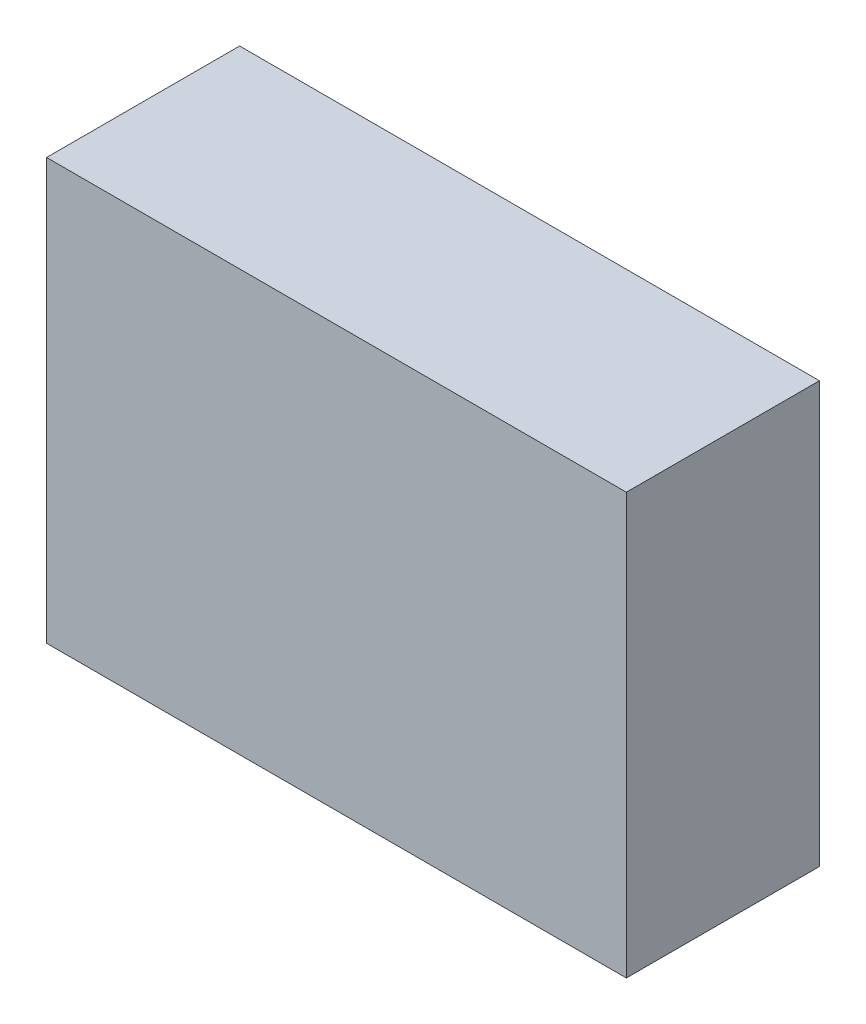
ISO-10303-21;
HEADER;
FILE_DESCRIPTION(('STEP AP214'),'2;1');
FILE_NAME('part.step','',(''),(''),'','','');
FILE_SCHEMA(('AUTOMOTIVE_DESIGN { 1 0 10303 214 1 1 1 1 }'));
ENDSEC;
DATA;
#1=APPLICATION_CONTEXT('core data for automotive mechanical design processes');
#2=APPLICATION_PROTOCOL_DEFINITION('international standard','automotive_design',2000,#1);
#3=PRODUCT_CONTEXT('',#1,'mechanical');
#4=PRODUCT('Part','Part','',(#3));
#5=PRODUCT_RELATED_PRODUCT_CATEGORY('part','',(#4));
#6=PRODUCT_DEFINITION_FORMATION('','',#4);
#7=PRODUCT_DEFINITION_CONTEXT('part definition',#1,'design');
#8=PRODUCT_DEFINITION('design','',#6,#7);
#9=PRODUCT_DEFINITION_SHAPE('','',#8);
#10=(LENGTH_UNIT() NAMED_UNIT(*) SI_UNIT(.MILLI.,.METRE.));
#11=(NAMED_UNIT(*) PLANE_ANGLE_UNIT() SI_UNIT($,.RADIAN.));
#12=(NAMED_UNIT(*) SI_UNIT($,.STERADIAN.) SOLID_ANGLE_UNIT());
#13=UNCERTAINTY_MEASURE_WITH_UNIT(LENGTH_MEASURE(1.E-05),#10,'distance_accuracy_value','');
#14=(GEOMETRIC_REPRESENTATION_CONTEXT(3) GLOBAL_UNCERTAINTY_ASSIGNED_CONTEXT((#13)) GLOBAL_UNIT_ASSIGNED_CONTEXT((#10,
#11,#12)) REPRESENTATION_CONTEXT('',''));
#15=CARTESIAN_POINT('',(0.,0.,0.));
#16=DIRECTION('',(0.,0.,1.));
#17=DIRECTION('',(1.,0.,0.));
#18=AXIS2_PLACEMENT_3D('',#15,#16,#17);
#19=CARTESIAN_POINT('',(0.,0.,16.51));
#20=DIRECTION('',(1.,0.,0.));
#21=DIRECTION('',(0.,0.,-1.));
#22=AXIS2_PLACEMENT_3D('',#19,#20,#21);
#23=PLANE('',#22);
#24=DIRECTION('',(0.,-1.,0.));
#25=VECTOR('',#24,1.);
#26=CARTESIAN_POINT('',(0.,0.,0.));
#27=LINE('',#26,#25);
#28=CARTESIAN_POINT('',(0.,35.9779903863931,0.));
#29=VERTEX_POINT('',#28);
#30=CARTESIAN_POINT('',(0.,0.,0.));
#31=VERTEX_POINT('',#30);
#32=EDGE_CURVE('E77',#29,#31,#27,.T.);
#33=ORIENTED_EDGE('',*,*,#32,.T.);
#34=DIRECTION('',(0.,0.,-1.));
#35=VECTOR('',#34,1.);
#36=CARTESIAN_POINT('',(0.,0.,16.51));
#37=LINE('',#36,#35);
#38=CARTESIAN_POINT('',(0.,0.,16.51));
#39=VERTEX_POINT('',#38);
#40=EDGE_CURVE('E11',#39,#31,#37,.T.);
#41=ORIENTED_EDGE('',*,*,#40,.F.);
#42=DIRECTION('',(0.,-1.,0.));
#43=VECTOR('',#42,1.);
#44=CARTESIAN_POINT('',(0.,0.,16.51));
#45=LINE('',#44,#43);
#46=CARTESIAN_POINT('',(0.,35.9779903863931,16.51));
#47=VERTEX_POINT('',#46);
#48=EDGE_CURVE('E95',#47,#39,#45,.T.);
#49=ORIENTED_EDGE('',*,*,#48,.F.);
#50=DIRECTION('',(0.,0.,-1.));
#51=VECTOR('',#50,1.);
#52=CARTESIAN_POINT('',(0.,35.9779903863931,16.51));
#53=LINE('',#52,#51);
#54=EDGE_CURVE('E89',#47,#29,#53,.T.);
#55=ORIENTED_EDGE('',*,*,#54,.T.);
#56=EDGE_LOOP('',(#33,#41,#49,#55));
#57=FACE_BOUND('',#56,.T.);
#58=ADVANCED_FACE('F33',(#57),#23,.F.);
#59=CARTESIAN_POINT('',(0.,0.,16.51));
#60=DIRECTION('',(0.,1.,0.));
#61=DIRECTION('',(0.,0.,1.));
#62=AXIS2_PLACEMENT_3D('',#59,#60,#61);
#63=PLANE('',#62);
#64=DIRECTION('',(1.,0.,0.));
#65=VECTOR('',#64,1.);
#66=CARTESIAN_POINT('',(0.,0.,0.));
#67=LINE('',#66,#65);
#68=CARTESIAN_POINT('',(49.5809761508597,0.,0.));
#69=VERTEX_POINT('',#68);
#70=EDGE_CURVE('E73',#31,#69,#67,.T.);
#71=ORIENTED_EDGE('',*,*,#70,.T.);
#72=DIRECTION('',(0.,0.,-1.));
#73=VECTOR('',#72,1.);
#74=CARTESIAN_POINT('',(49.5809761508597,0.,16.51));
#75=LINE('',#74,#73);
#76=CARTESIAN_POINT('',(49.5809761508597,0.,16.51));
#77=VERTEX_POINT('',#76);
#78=EDGE_CURVE('E40',#77,#69,#75,.T.);
#79=ORIENTED_EDGE('',*,*,#78,.F.);
#80=DIRECTION('',(1.,0.,0.));
#81=VECTOR('',#80,1.);
#82=CARTESIAN_POINT('',(0.,0.,16.51));
#83=LINE('',#82,#81);
#84=EDGE_CURVE('E85',#39,#77,#83,.T.);
#85=ORIENTED_EDGE('',*,*,#84,.F.);
#86=ORIENTED_EDGE('',*,*,#40,.T.);
#87=EDGE_LOOP('',(#71,#79,#85,#86));
#88=FACE_BOUND('',#87,.T.);
#89=ADVANCED_FACE('F84',(#88),#63,.F.);
#90=CARTESIAN_POINT('',(49.5809761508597,0.,16.51));
#91=DIRECTION('',(-1.,0.,0.));
#92=DIRECTION('',(0.,0.,1.));
#93=AXIS2_PLACEMENT_3D('',#90,#91,#92);
#94=PLANE('',#93);
#95=DIRECTION('',(0.,1.,0.));
#96=VECTOR('',#95,1.);
#97=CARTESIAN_POINT('',(49.5809761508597,0.,0.));
#98=LINE('',#97,#96);
#99=CARTESIAN_POINT('',(49.5809761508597,35.9779903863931,0.));
#100=VERTEX_POINT('',#99);
#101=EDGE_CURVE('E78',#69,#100,#98,.T.);
#102=ORIENTED_EDGE('',*,*,#101,.T.);
#103=DIRECTION('',(0.,0.,-1.));
#104=VECTOR('',#103,1.);
#105=CARTESIAN_POINT('',(49.5809761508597,35.9779903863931,16.51));
#106=LINE('',#105,#104);
#107=CARTESIAN_POINT('',(49.5809761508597,35.9779903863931,16.51));
#108=VERTEX_POINT('',#107);
#109=EDGE_CURVE('E101',#108,#100,#106,.T.);
#110=ORIENTED_EDGE('',*,*,#109,.F.);
#111=DIRECTION('',(0.,1.,0.));
#112=VECTOR('',#111,1.);
#113=CARTESIAN_POINT('',(49.5809761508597,0.,16.51));
#114=LINE('',#113,#112);
#115=EDGE_CURVE('E52',#77,#108,#114,.T.);
#116=ORIENTED_EDGE('',*,*,#115,.F.);
#117=ORIENTED_EDGE('',*,*,#78,.T.);
#118=EDGE_LOOP('',(#102,#110,#116,#117));
#119=FACE_BOUND('',#118,.T.);
#120=ADVANCED_FACE('F104',(#119),#94,.F.);
#121=CARTESIAN_POINT('',(0.,35.9779903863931,16.51));
#122=DIRECTION('',(0.,-1.,0.));
#123=DIRECTION('',(0.,0.,-1.));
#124=AXIS2_PLACEMENT_3D('',#121,#122,#123);
#125=PLANE('',#124);
#126=DIRECTION('',(-1.,0.,0.));
#127=VECTOR('',#126,1.);
#128=CARTESIAN_POINT('',(0.,35.9779903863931,0.));
#129=LINE('',#128,#127);
#130=EDGE_CURVE('E93',#100,#29,#129,.T.);
#131=ORIENTED_EDGE('',*,*,#130,.T.);
#132=ORIENTED_EDGE('',*,*,#54,.F.);
#133=DIRECTION('',(-1.,0.,0.));
#134=VECTOR('',#133,1.);
#135=CARTESIAN_POINT('',(0.,35.9779903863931,16.51));
#136=LINE('',#135,#134);
#137=EDGE_CURVE('E47',#108,#47,#136,.T.);
#138=ORIENTED_EDGE('',*,*,#137,.F.);
#139=ORIENTED_EDGE('',*,*,#109,.T.);
#140=EDGE_LOOP('',(#131,#132,#138,#139));
#141=FACE_BOUND('',#140,.T.);
#142=ADVANCED_FACE('F106',(#141),#125,.F.);
#143=CARTESIAN_POINT('',(0.,35.9779903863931,16.51));
#144=DIRECTION('',(0.,0.,-1.));
#145=DIRECTION('',(-1.,0.,0.));
#146=AXIS2_PLACEMENT_3D('',#143,#144,#145);
#147=PLANE('',#146);
#148=ORIENTED_EDGE('',*,*,#48,.T.);
#149=ORIENTED_EDGE('',*,*,#84,.T.);
#150=ORIENTED_EDGE('',*,*,#115,.T.);
#151=ORIENTED_EDGE('',*,*,#137,.T.);
#152=EDGE_LOOP('',(#148,#149,#150,#151));
#153=FACE_BOUND('',#152,.T.);
#154=ADVANCED_FACE('F107',(#153),#147,.F.);
#155=CARTESIAN_POINT('',(0.,35.9779903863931,0.));
#156=DIRECTION('',(0.,0.,-1.));
#157=DIRECTION('',(-1.,0.,0.));
#158=AXIS2_PLACEMENT_3D('',#155,#156,#157);
#159=PLANE('',#158);
#160=ORIENTED_EDGE('',*,*,#32,.F.);
#161=ORIENTED_EDGE('',*,*,#130,.F.);
#162=ORIENTED_EDGE('',*,*,#101,.F.);
#163=ORIENTED_EDGE('',*,*,#70,.F.);
#164=EDGE_LOOP('',(#160,#161,#162,#163));
#165=FACE_BOUND('',#164,.T.);
#166=ADVANCED_FACE('F74',(#165),#159,.T.);
#167=CLOSED_SHELL('',(#58,#89,#120,#142,#154,#166));
#168=MANIFOLD_SOLID_BREP('B2',#167);
#169=ADVANCED_BREP_SHAPE_REPRESENTATION('',(#18,#168),#14);
#170=SHAPE_DEFINITION_REPRESENTATION(#9,#169);
ENDSEC;
END-ISO-10303-21;
